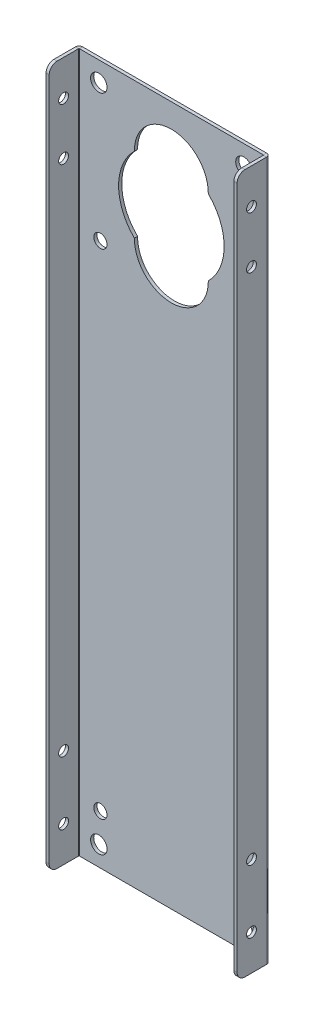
ISO-10303-21;
HEADER;
FILE_DESCRIPTION(('STEP AP214'),'2;1');
FILE_NAME('part.step','',(''),(''),'','','');
FILE_SCHEMA(('AUTOMOTIVE_DESIGN { 1 0 10303 214 1 1 1 1 }'));
ENDSEC;
DATA;
#1=APPLICATION_CONTEXT('core data for automotive mechanical design processes');
#2=APPLICATION_PROTOCOL_DEFINITION('international standard','automotive_design',2000,#1);
#3=PRODUCT_CONTEXT('',#1,'mechanical');
#4=PRODUCT('Part','Part','',(#3));
#5=PRODUCT_RELATED_PRODUCT_CATEGORY('part','',(#4));
#6=PRODUCT_DEFINITION_FORMATION('','',#4);
#7=PRODUCT_DEFINITION_CONTEXT('part definition',#1,'design');
#8=PRODUCT_DEFINITION('design','',#6,#7);
#9=PRODUCT_DEFINITION_SHAPE('','',#8);
#10=(LENGTH_UNIT() NAMED_UNIT(*) SI_UNIT(.MILLI.,.METRE.));
#11=(NAMED_UNIT(*) PLANE_ANGLE_UNIT() SI_UNIT($,.RADIAN.));
#12=(NAMED_UNIT(*) SI_UNIT($,.STERADIAN.) SOLID_ANGLE_UNIT());
#13=UNCERTAINTY_MEASURE_WITH_UNIT(LENGTH_MEASURE(1.E-05),#10,'distance_accuracy_value','');
#14=(GEOMETRIC_REPRESENTATION_CONTEXT(3) GLOBAL_UNCERTAINTY_ASSIGNED_CONTEXT((#13)) GLOBAL_UNIT_ASSIGNED_CONTEXT((#10,
#11,#12)) REPRESENTATION_CONTEXT('',''));
#15=CARTESIAN_POINT('',(0.,0.,0.));
#16=DIRECTION('',(0.,0.,1.));
#17=DIRECTION('',(1.,0.,0.));
#18=AXIS2_PLACEMENT_3D('',#15,#16,#17);
#19=CARTESIAN_POINT('',(-45.974,-168.275,1.51892));
#20=DIRECTION('',(0.,1.,0.));
#21=DIRECTION('',(0.,0.,1.));
#22=AXIS2_PLACEMENT_3D('',#19,#20,#21);
#23=PLANE('',#22);
#24=DIRECTION('',(0.,0.,-1.));
#25=VECTOR('',#24,1.);
#26=CARTESIAN_POINT('',(44.25188,-168.275,1.51891999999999));
#27=LINE('',#26,#25);
#28=CARTESIAN_POINT('',(44.25188,-168.275,1.51892));
#29=VERTEX_POINT('',#28);
#30=CARTESIAN_POINT('',(44.25188,-168.275,0.));
#31=VERTEX_POINT('',#30);
#32=EDGE_CURVE('E300',#29,#31,#27,.T.);
#33=ORIENTED_EDGE('',*,*,#32,.F.);
#34=DIRECTION('',(1.,0.,0.));
#35=VECTOR('',#34,1.);
#36=CARTESIAN_POINT('',(-45.974,-168.275,1.51892));
#37=LINE('',#36,#35);
#38=CARTESIAN_POINT('',(-44.25188,-168.275,1.51892));
#39=VERTEX_POINT('',#38);
#40=EDGE_CURVE('E355',#39,#29,#37,.T.);
#41=ORIENTED_EDGE('',*,*,#40,.F.);
#42=DIRECTION('',(0.,0.,-1.));
#43=VECTOR('',#42,1.);
#44=CARTESIAN_POINT('',(-44.25188,-168.275,1.51892000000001));
#45=LINE('',#44,#43);
#46=CARTESIAN_POINT('',(-44.25188,-168.275,0.));
#47=VERTEX_POINT('',#46);
#48=EDGE_CURVE('E339',#39,#47,#45,.T.);
#49=ORIENTED_EDGE('',*,*,#48,.T.);
#50=DIRECTION('',(1.,0.,0.));
#51=VECTOR('',#50,1.);
#52=CARTESIAN_POINT('',(-45.974,-168.275,0.));
#53=LINE('',#52,#51);
#54=EDGE_CURVE('E353',#47,#31,#53,.T.);
#55=ORIENTED_EDGE('',*,*,#54,.T.);
#56=EDGE_LOOP('',(#33,#41,#49,#55));
#57=FACE_BOUND('',#56,.T.);
#58=ADVANCED_FACE('F76',(#57),#23,.F.);
#59=CARTESIAN_POINT('',(-45.974,168.275,1.51892));
#60=DIRECTION('',(0.,-1.,0.));
#61=DIRECTION('',(0.,0.,-1.));
#62=AXIS2_PLACEMENT_3D('',#59,#60,#61);
#63=PLANE('',#62);
#64=DIRECTION('',(0.,0.,-1.));
#65=VECTOR('',#64,1.);
#66=CARTESIAN_POINT('',(44.25188,168.275,1.51891999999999));
#67=LINE('',#66,#65);
#68=CARTESIAN_POINT('',(44.25188,168.275,1.51892));
#69=VERTEX_POINT('',#68);
#70=CARTESIAN_POINT('',(44.25188,168.275,0.));
#71=VERTEX_POINT('',#70);
#72=EDGE_CURVE('E289',#69,#71,#67,.T.);
#73=ORIENTED_EDGE('',*,*,#72,.T.);
#74=DIRECTION('',(-1.,0.,0.));
#75=VECTOR('',#74,1.);
#76=CARTESIAN_POINT('',(-45.974,168.275,0.));
#77=LINE('',#76,#75);
#78=CARTESIAN_POINT('',(-44.25188,168.275,0.));
#79=VERTEX_POINT('',#78);
#80=EDGE_CURVE('E359',#71,#79,#77,.T.);
#81=ORIENTED_EDGE('',*,*,#80,.T.);
#82=DIRECTION('',(0.,0.,-1.));
#83=VECTOR('',#82,1.);
#84=CARTESIAN_POINT('',(-44.25188,168.275,1.51892000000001));
#85=LINE('',#84,#83);
#86=CARTESIAN_POINT('',(-44.25188,168.275,1.51892));
#87=VERTEX_POINT('',#86);
#88=EDGE_CURVE('E350',#87,#79,#85,.T.);
#89=ORIENTED_EDGE('',*,*,#88,.F.);
#90=DIRECTION('',(-1.,0.,0.));
#91=VECTOR('',#90,1.);
#92=CARTESIAN_POINT('',(-45.974,168.275,1.51892));
#93=LINE('',#92,#91);
#94=EDGE_CURVE('E358',#69,#87,#93,.T.);
#95=ORIENTED_EDGE('',*,*,#94,.F.);
#96=EDGE_LOOP('',(#73,#81,#89,#95));
#97=FACE_BOUND('',#96,.T.);
#98=ADVANCED_FACE('F566',(#97),#63,.F.);
#99=CARTESIAN_POINT('',(0.,0.,1.51892));
#100=DIRECTION('',(0.,0.,1.));
#101=DIRECTION('',(1.,0.,0.));
#102=AXIS2_PLACEMENT_3D('',#99,#100,#101);
#103=PLANE('',#102);
#104=CARTESIAN_POINT('',(-34.9309613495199,158.75435671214,1.51892));
#105=DIRECTION('',(0.,0.,-1.));
#106=DIRECTION('',(-1.,0.,0.));
#107=AXIS2_PLACEMENT_3D('',#104,#105,#106);
#108=CIRCLE('',#107,3.96239999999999);
#109=CARTESIAN_POINT('',(-38.8933613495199,158.75435671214,1.51892));
#110=VERTEX_POINT('',#109);
#111=EDGE_CURVE('E477',#110,#110,#108,.T.);
#112=ORIENTED_EDGE('',*,*,#111,.T.);
#113=EDGE_LOOP('',(#112));
#114=FACE_BOUND('',#113,.T.);
#115=CARTESIAN_POINT('',(34.91903865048,158.74182662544,1.51892));
#116=DIRECTION('',(0.,0.,-1.));
#117=DIRECTION('',(-1.,0.,0.));
#118=AXIS2_PLACEMENT_3D('',#115,#116,#117);
#119=CIRCLE('',#118,3.96239999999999);
#120=CARTESIAN_POINT('',(30.95663865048,158.74182662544,1.51892));
#121=VERTEX_POINT('',#120);
#122=EDGE_CURVE('E472',#121,#121,#119,.T.);
#123=ORIENTED_EDGE('',*,*,#122,.T.);
#124=EDGE_LOOP('',(#123));
#125=FACE_BOUND('',#124,.T.);
#126=CARTESIAN_POINT('',(34.15703865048,93.22958535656,1.51892));
#127=DIRECTION('',(0.,0.,-1.));
#128=DIRECTION('',(-1.,0.,0.));
#129=AXIS2_PLACEMENT_3D('',#126,#127,#128);
#130=CIRCLE('',#129,3.175);
#131=CARTESIAN_POINT('',(30.98203865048,93.22958535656,1.51892));
#132=VERTEX_POINT('',#131);
#133=EDGE_CURVE('E466',#132,#132,#130,.T.);
#134=ORIENTED_EDGE('',*,*,#133,.T.);
#135=EDGE_LOOP('',(#134));
#136=FACE_BOUND('',#135,.T.);
#137=CARTESIAN_POINT('',(-34.16896134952,93.22958535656,1.51892));
#138=DIRECTION('',(0.,0.,-1.));
#139=DIRECTION('',(-1.,0.,0.));
#140=AXIS2_PLACEMENT_3D('',#137,#138,#139);
#141=CIRCLE('',#140,3.175);
#142=CARTESIAN_POINT('',(-37.34396134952,93.22958535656,1.51892));
#143=VERTEX_POINT('',#142);
#144=EDGE_CURVE('E460',#143,#143,#141,.T.);
#145=ORIENTED_EDGE('',*,*,#144,.T.);
#146=EDGE_LOOP('',(#145));
#147=FACE_BOUND('',#146,.T.);
#148=CARTESIAN_POINT('',(34.15703865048,-144.51486366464,1.51892));
#149=DIRECTION('',(0.,0.,-1.));
#150=DIRECTION('',(-1.,0.,0.));
#151=AXIS2_PLACEMENT_3D('',#148,#149,#150);
#152=CIRCLE('',#151,3.175);
#153=CARTESIAN_POINT('',(30.98203865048,-144.51486366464,1.51892));
#154=VERTEX_POINT('',#153);
#155=EDGE_CURVE('E454',#154,#154,#152,.T.);
#156=ORIENTED_EDGE('',*,*,#155,.T.);
#157=EDGE_LOOP('',(#156));
#158=FACE_BOUND('',#157,.T.);
#159=CARTESIAN_POINT('',(34.91903865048,-158.75817337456,1.51892));
#160=DIRECTION('',(0.,0.,-1.));
#161=DIRECTION('',(-1.,0.,0.));
#162=AXIS2_PLACEMENT_3D('',#159,#160,#161);
#163=CIRCLE('',#162,3.96239999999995);
#164=CARTESIAN_POINT('',(30.9566386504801,-158.75817337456,1.51892));
#165=VERTEX_POINT('',#164);
#166=EDGE_CURVE('E448',#165,#165,#163,.T.);
#167=ORIENTED_EDGE('',*,*,#166,.T.);
#168=EDGE_LOOP('',(#167));
#169=FACE_BOUND('',#168,.T.);
#170=CARTESIAN_POINT('',(-34.16896134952,-144.51486366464,1.51892));
#171=DIRECTION('',(0.,0.,-1.));
#172=DIRECTION('',(-1.,0.,0.));
#173=AXIS2_PLACEMENT_3D('',#170,#171,#172);
#174=CIRCLE('',#173,3.175);
#175=CARTESIAN_POINT('',(-37.34396134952,-144.51486366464,1.51892));
#176=VERTEX_POINT('',#175);
#177=EDGE_CURVE('E442',#176,#176,#174,.T.);
#178=ORIENTED_EDGE('',*,*,#177,.T.);
#179=EDGE_LOOP('',(#178));
#180=FACE_BOUND('',#179,.T.);
#181=CARTESIAN_POINT('',(-34.9309613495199,-158.75817337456,1.51892));
#182=DIRECTION('',(0.,0.,-1.));
#183=DIRECTION('',(-1.,0.,0.));
#184=AXIS2_PLACEMENT_3D('',#181,#182,#183);
#185=CIRCLE('',#184,3.96239999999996);
#186=CARTESIAN_POINT('',(-38.8933613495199,-158.75817337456,1.51892));
#187=VERTEX_POINT('',#186);
#188=EDGE_CURVE('E246',#187,#187,#185,.T.);
#189=ORIENTED_EDGE('',*,*,#188,.T.);
#190=EDGE_LOOP('',(#189));
#191=FACE_BOUND('',#190,.T.);
#192=CARTESIAN_POINT('',(-0.00596134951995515,102.228583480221,1.51892));
#193=DIRECTION('',(0.,0.,-1.));
#194=DIRECTION('',(-1.,0.,0.));
#195=AXIS2_PLACEMENT_3D('',#192,#193,#194);
#196=CIRCLE('',#195,17.78);
#197=CARTESIAN_POINT('',(17.7719317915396,102.502290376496,1.51892));
#198=VERTEX_POINT('',#197);
#199=CARTESIAN_POINT('',(-17.7838544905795,102.502290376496,1.51892));
#200=VERTEX_POINT('',#199);
#201=EDGE_CURVE('E217',#198,#200,#196,.T.);
#202=ORIENTED_EDGE('',*,*,#201,.T.);
#203=CARTESIAN_POINT('',(-0.00596134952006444,120.64358347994,1.51892));
#204=DIRECTION('',(0.,0.,-1.));
#205=DIRECTION('',(-1.,0.,0.));
#206=AXIS2_PLACEMENT_3D('',#203,#204,#205);
#207=CIRCLE('',#206,25.4);
#208=CARTESIAN_POINT('',(-17.7838544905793,138.784876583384,1.51892));
#209=VERTEX_POINT('',#208);
#210=EDGE_CURVE('E226',#200,#209,#207,.T.);
#211=ORIENTED_EDGE('',*,*,#210,.T.);
#212=CARTESIAN_POINT('',(-0.00596134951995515,139.058583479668,1.51892));
#213=DIRECTION('',(0.,0.,-1.));
#214=DIRECTION('',(-1.,0.,0.));
#215=AXIS2_PLACEMENT_3D('',#212,#213,#214);
#216=CIRCLE('',#215,17.78);
#217=CARTESIAN_POINT('',(17.7719317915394,138.784876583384,1.51892));
#218=VERTEX_POINT('',#217);
#219=EDGE_CURVE('E93',#209,#218,#216,.T.);
#220=ORIENTED_EDGE('',*,*,#219,.T.);
#221=CARTESIAN_POINT('',(-0.00596134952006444,120.64358347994,1.51892));
#222=DIRECTION('',(0.,0.,-1.));
#223=DIRECTION('',(-1.,0.,0.));
#224=AXIS2_PLACEMENT_3D('',#221,#222,#223);
#225=CIRCLE('',#224,25.4000000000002);
#226=EDGE_CURVE('E223',#218,#198,#225,.T.);
#227=ORIENTED_EDGE('',*,*,#226,.T.);
#228=EDGE_LOOP('',(#202,#211,#220,#227));
#229=FACE_BOUND('',#228,.T.);
#230=ORIENTED_EDGE('',*,*,#40,.T.);
#231=DIRECTION('',(0.,1.,0.));
#232=VECTOR('',#231,1.);
#233=CARTESIAN_POINT('',(44.25188,168.275,1.51891999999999));
#234=LINE('',#233,#232);
#235=EDGE_CURVE('E295',#69,#29,#234,.F.);
#236=ORIENTED_EDGE('',*,*,#235,.F.);
#237=ORIENTED_EDGE('',*,*,#94,.T.);
#238=DIRECTION('',(0.,-1.,0.));
#239=VECTOR('',#238,1.);
#240=CARTESIAN_POINT('',(-44.25188,-168.275,1.51892000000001));
#241=LINE('',#240,#239);
#242=EDGE_CURVE('E345',#39,#87,#241,.F.);
#243=ORIENTED_EDGE('',*,*,#242,.F.);
#244=EDGE_LOOP('',(#230,#236,#237,#243));
#245=FACE_BOUND('',#244,.T.);
#246=ADVANCED_FACE('F230',(#114,#125,#136,#147,#158,#169,#180,#191,#229,#245),#103,.T.);
#247=CARTESIAN_POINT('',(0.,0.,0.));
#248=DIRECTION('',(0.,0.,1.));
#249=DIRECTION('',(1.,0.,0.));
#250=AXIS2_PLACEMENT_3D('',#247,#248,#249);
#251=PLANE('',#250);
#252=CARTESIAN_POINT('',(-34.9309613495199,158.75435671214,0.));
#253=DIRECTION('',(0.,0.,-1.));
#254=DIRECTION('',(-1.,0.,0.));
#255=AXIS2_PLACEMENT_3D('',#252,#253,#254);
#256=CIRCLE('',#255,3.96239999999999);
#257=CARTESIAN_POINT('',(-38.8933613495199,158.75435671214,0.));
#258=VERTEX_POINT('',#257);
#259=EDGE_CURVE('E239',#258,#258,#256,.T.);
#260=ORIENTED_EDGE('',*,*,#259,.F.);
#261=EDGE_LOOP('',(#260));
#262=FACE_BOUND('',#261,.T.);
#263=CARTESIAN_POINT('',(34.91903865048,158.74182662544,0.));
#264=DIRECTION('',(0.,0.,-1.));
#265=DIRECTION('',(-1.,0.,0.));
#266=AXIS2_PLACEMENT_3D('',#263,#264,#265);
#267=CIRCLE('',#266,3.96239999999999);
#268=CARTESIAN_POINT('',(30.95663865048,158.74182662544,0.));
#269=VERTEX_POINT('',#268);
#270=EDGE_CURVE('E475',#269,#269,#267,.T.);
#271=ORIENTED_EDGE('',*,*,#270,.F.);
#272=EDGE_LOOP('',(#271));
#273=FACE_BOUND('',#272,.T.);
#274=CARTESIAN_POINT('',(34.15703865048,93.22958535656,0.));
#275=DIRECTION('',(0.,0.,-1.));
#276=DIRECTION('',(-1.,0.,0.));
#277=AXIS2_PLACEMENT_3D('',#274,#275,#276);
#278=CIRCLE('',#277,3.175);
#279=CARTESIAN_POINT('',(30.98203865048,93.22958535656,0.));
#280=VERTEX_POINT('',#279);
#281=EDGE_CURVE('E469',#280,#280,#278,.T.);
#282=ORIENTED_EDGE('',*,*,#281,.F.);
#283=EDGE_LOOP('',(#282));
#284=FACE_BOUND('',#283,.T.);
#285=CARTESIAN_POINT('',(-34.16896134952,93.22958535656,0.));
#286=DIRECTION('',(0.,0.,-1.));
#287=DIRECTION('',(-1.,0.,0.));
#288=AXIS2_PLACEMENT_3D('',#285,#286,#287);
#289=CIRCLE('',#288,3.175);
#290=CARTESIAN_POINT('',(-37.34396134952,93.22958535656,0.));
#291=VERTEX_POINT('',#290);
#292=EDGE_CURVE('E463',#291,#291,#289,.T.);
#293=ORIENTED_EDGE('',*,*,#292,.F.);
#294=EDGE_LOOP('',(#293));
#295=FACE_BOUND('',#294,.T.);
#296=CARTESIAN_POINT('',(34.15703865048,-144.51486366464,0.));
#297=DIRECTION('',(0.,0.,-1.));
#298=DIRECTION('',(-1.,0.,0.));
#299=AXIS2_PLACEMENT_3D('',#296,#297,#298);
#300=CIRCLE('',#299,3.175);
#301=CARTESIAN_POINT('',(30.98203865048,-144.51486366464,0.));
#302=VERTEX_POINT('',#301);
#303=EDGE_CURVE('E457',#302,#302,#300,.T.);
#304=ORIENTED_EDGE('',*,*,#303,.F.);
#305=EDGE_LOOP('',(#304));
#306=FACE_BOUND('',#305,.T.);
#307=CARTESIAN_POINT('',(34.91903865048,-158.75817337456,0.));
#308=DIRECTION('',(0.,0.,-1.));
#309=DIRECTION('',(-1.,0.,0.));
#310=AXIS2_PLACEMENT_3D('',#307,#308,#309);
#311=CIRCLE('',#310,3.96239999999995);
#312=CARTESIAN_POINT('',(30.9566386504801,-158.75817337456,0.));
#313=VERTEX_POINT('',#312);
#314=EDGE_CURVE('E451',#313,#313,#311,.T.);
#315=ORIENTED_EDGE('',*,*,#314,.F.);
#316=EDGE_LOOP('',(#315));
#317=FACE_BOUND('',#316,.T.);
#318=CARTESIAN_POINT('',(-34.16896134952,-144.51486366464,0.));
#319=DIRECTION('',(0.,0.,-1.));
#320=DIRECTION('',(-1.,0.,0.));
#321=AXIS2_PLACEMENT_3D('',#318,#319,#320);
#322=CIRCLE('',#321,3.175);
#323=CARTESIAN_POINT('',(-37.34396134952,-144.51486366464,0.));
#324=VERTEX_POINT('',#323);
#325=EDGE_CURVE('E445',#324,#324,#322,.T.);
#326=ORIENTED_EDGE('',*,*,#325,.F.);
#327=EDGE_LOOP('',(#326));
#328=FACE_BOUND('',#327,.T.);
#329=CARTESIAN_POINT('',(-34.9309613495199,-158.75817337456,0.));
#330=DIRECTION('',(0.,0.,-1.));
#331=DIRECTION('',(-1.,0.,0.));
#332=AXIS2_PLACEMENT_3D('',#329,#330,#331);
#333=CIRCLE('',#332,3.96239999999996);
#334=CARTESIAN_POINT('',(-38.8933613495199,-158.75817337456,0.));
#335=VERTEX_POINT('',#334);
#336=EDGE_CURVE('E439',#335,#335,#333,.T.);
#337=ORIENTED_EDGE('',*,*,#336,.F.);
#338=EDGE_LOOP('',(#337));
#339=FACE_BOUND('',#338,.T.);
#340=CARTESIAN_POINT('',(-0.00596134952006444,120.64358347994,0.));
#341=DIRECTION('',(0.,0.,-1.));
#342=DIRECTION('',(-1.,0.,0.));
#343=AXIS2_PLACEMENT_3D('',#340,#341,#342);
#344=CIRCLE('',#343,25.4);
#345=CARTESIAN_POINT('',(-17.7838544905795,102.502290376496,0.));
#346=VERTEX_POINT('',#345);
#347=CARTESIAN_POINT('',(-17.7838544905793,138.784876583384,0.));
#348=VERTEX_POINT('',#347);
#349=EDGE_CURVE('E245',#346,#348,#344,.T.);
#350=ORIENTED_EDGE('',*,*,#349,.F.);
#351=CARTESIAN_POINT('',(-0.00596134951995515,102.228583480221,0.));
#352=DIRECTION('',(0.,0.,-1.));
#353=DIRECTION('',(-1.,0.,0.));
#354=AXIS2_PLACEMENT_3D('',#351,#352,#353);
#355=CIRCLE('',#354,17.78);
#356=CARTESIAN_POINT('',(17.7719317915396,102.502290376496,0.));
#357=VERTEX_POINT('',#356);
#358=EDGE_CURVE('E101',#357,#346,#355,.T.);
#359=ORIENTED_EDGE('',*,*,#358,.F.);
#360=CARTESIAN_POINT('',(-0.00596134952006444,120.64358347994,0.));
#361=DIRECTION('',(0.,0.,-1.));
#362=DIRECTION('',(-1.,0.,0.));
#363=AXIS2_PLACEMENT_3D('',#360,#361,#362);
#364=CIRCLE('',#363,25.4000000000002);
#365=CARTESIAN_POINT('',(17.7719317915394,138.784876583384,0.));
#366=VERTEX_POINT('',#365);
#367=EDGE_CURVE('E233',#366,#357,#364,.T.);
#368=ORIENTED_EDGE('',*,*,#367,.F.);
#369=CARTESIAN_POINT('',(-0.00596134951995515,139.058583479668,0.));
#370=DIRECTION('',(0.,0.,-1.));
#371=DIRECTION('',(-1.,0.,0.));
#372=AXIS2_PLACEMENT_3D('',#369,#370,#371);
#373=CIRCLE('',#372,17.78);
#374=EDGE_CURVE('E236',#348,#366,#373,.T.);
#375=ORIENTED_EDGE('',*,*,#374,.F.);
#376=EDGE_LOOP('',(#350,#359,#368,#375));
#377=FACE_BOUND('',#376,.T.);
#378=DIRECTION('',(0.,1.,0.));
#379=VECTOR('',#378,1.);
#380=CARTESIAN_POINT('',(44.25188,168.275,0.));
#381=LINE('',#380,#379);
#382=EDGE_CURVE('E283',#71,#31,#381,.F.);
#383=ORIENTED_EDGE('',*,*,#382,.T.);
#384=ORIENTED_EDGE('',*,*,#54,.F.);
#385=DIRECTION('',(0.,-1.,0.));
#386=VECTOR('',#385,1.);
#387=CARTESIAN_POINT('',(-44.25188,-168.275,0.));
#388=LINE('',#387,#386);
#389=EDGE_CURVE('E332',#47,#79,#388,.F.);
#390=ORIENTED_EDGE('',*,*,#389,.T.);
#391=ORIENTED_EDGE('',*,*,#80,.F.);
#392=EDGE_LOOP('',(#383,#384,#390,#391));
#393=FACE_BOUND('',#392,.T.);
#394=ADVANCED_FACE('F486',(#262,#273,#284,#295,#306,#317,#328,#339,#377,#393),#251,.F.);
#395=CARTESIAN_POINT('',(-44.25188,168.275,1.72212));
#396=DIRECTION('',(0.,1.,0.));
#397=DIRECTION('',(0.,0.,1.));
#398=AXIS2_PLACEMENT_3D('',#395,#396,#397);
#399=PLANE('',#398);
#400=DIRECTION('',(1.,0.,0.));
#401=VECTOR('',#400,1.);
#402=CARTESIAN_POINT('',(-45.974,168.275,1.72212));
#403=LINE('',#402,#401);
#404=CARTESIAN_POINT('',(-44.45508,168.275,1.72212));
#405=VERTEX_POINT('',#404);
#406=CARTESIAN_POINT('',(-45.974,168.275,1.72212));
#407=VERTEX_POINT('',#406);
#408=EDGE_CURVE('E303',#405,#407,#403,.F.);
#409=ORIENTED_EDGE('',*,*,#408,.F.);
#410=CARTESIAN_POINT('',(-44.25188,168.275,1.72212));
#411=DIRECTION('',(0.,-1.,0.));
#412=DIRECTION('',(0.,0.,-1.));
#413=AXIS2_PLACEMENT_3D('',#410,#411,#412);
#414=CIRCLE('',#413,0.203199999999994);
#415=EDGE_CURVE('E342',#87,#405,#414,.F.);
#416=ORIENTED_EDGE('',*,*,#415,.F.);
#417=ORIENTED_EDGE('',*,*,#88,.T.);
#418=CARTESIAN_POINT('',(-44.25188,168.275,1.72212));
#419=DIRECTION('',(0.,-1.,0.));
#420=DIRECTION('',(0.,0.,-1.));
#421=AXIS2_PLACEMENT_3D('',#418,#419,#420);
#422=CIRCLE('',#421,1.72211999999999);
#423=EDGE_CURVE('E335',#79,#407,#422,.F.);
#424=ORIENTED_EDGE('',*,*,#423,.T.);
#425=EDGE_LOOP('',(#409,#416,#417,#424));
#426=FACE_BOUND('',#425,.T.);
#427=ADVANCED_FACE('F489',(#426),#399,.T.);
#428=CARTESIAN_POINT('',(-44.25188,-168.275,1.72212));
#429=DIRECTION('',(0.,1.,0.));
#430=DIRECTION('',(0.,0.,1.));
#431=AXIS2_PLACEMENT_3D('',#428,#429,#430);
#432=PLANE('',#431);
#433=CARTESIAN_POINT('',(-44.25188,-168.275,1.72212));
#434=DIRECTION('',(0.,-1.,0.));
#435=DIRECTION('',(0.,0.,-1.));
#436=AXIS2_PLACEMENT_3D('',#433,#434,#435);
#437=CIRCLE('',#436,0.203199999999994);
#438=CARTESIAN_POINT('',(-44.45508,-168.275,1.72212));
#439=VERTEX_POINT('',#438);
#440=EDGE_CURVE('E307',#439,#39,#437,.T.);
#441=ORIENTED_EDGE('',*,*,#440,.F.);
#442=DIRECTION('',(1.,0.,0.));
#443=VECTOR('',#442,1.);
#444=CARTESIAN_POINT('',(-44.45508,-168.275,1.72212000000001));
#445=LINE('',#444,#443);
#446=CARTESIAN_POINT('',(-45.974,-168.275,1.72212));
#447=VERTEX_POINT('',#446);
#448=EDGE_CURVE('E325',#439,#447,#445,.F.);
#449=ORIENTED_EDGE('',*,*,#448,.T.);
#450=CARTESIAN_POINT('',(-44.25188,-168.275,1.72212));
#451=DIRECTION('',(0.,-1.,0.));
#452=DIRECTION('',(0.,0.,-1.));
#453=AXIS2_PLACEMENT_3D('',#450,#451,#452);
#454=CIRCLE('',#453,1.72211999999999);
#455=EDGE_CURVE('E336',#447,#47,#454,.T.);
#456=ORIENTED_EDGE('',*,*,#455,.T.);
#457=ORIENTED_EDGE('',*,*,#48,.F.);
#458=EDGE_LOOP('',(#441,#449,#456,#457));
#459=FACE_BOUND('',#458,.T.);
#460=ADVANCED_FACE('F638',(#459),#432,.F.);
#461=CARTESIAN_POINT('',(-44.25188,-168.275,1.72212));
#462=DIRECTION('',(0.,-1.,0.));
#463=DIRECTION('',(-1.,0.,0.));
#464=AXIS2_PLACEMENT_3D('',#461,#462,#463);
#465=CYLINDRICAL_SURFACE('',#464,1.72211999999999);
#466=ORIENTED_EDGE('',*,*,#389,.F.);
#467=ORIENTED_EDGE('',*,*,#455,.F.);
#468=DIRECTION('',(0.,-1.,0.));
#469=VECTOR('',#468,1.);
#470=CARTESIAN_POINT('',(-45.974,168.275,1.72212));
#471=LINE('',#470,#469);
#472=EDGE_CURVE('E322',#447,#407,#471,.F.);
#473=ORIENTED_EDGE('',*,*,#472,.T.);
#474=ORIENTED_EDGE('',*,*,#423,.F.);
#475=EDGE_LOOP('',(#466,#467,#473,#474));
#476=FACE_BOUND('',#475,.T.);
#477=ADVANCED_FACE('F635',(#476),#465,.T.);
#478=CARTESIAN_POINT('',(-44.25188,-168.275,1.72212));
#479=DIRECTION('',(0.,-1.,0.));
#480=DIRECTION('',(-1.,0.,0.));
#481=AXIS2_PLACEMENT_3D('',#478,#479,#480);
#482=CYLINDRICAL_SURFACE('',#481,0.203199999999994);
#483=ORIENTED_EDGE('',*,*,#242,.T.);
#484=ORIENTED_EDGE('',*,*,#415,.T.);
#485=DIRECTION('',(0.,-1.,0.));
#486=VECTOR('',#485,1.);
#487=CARTESIAN_POINT('',(-44.45508,168.275,1.72212));
#488=LINE('',#487,#486);
#489=EDGE_CURVE('E328',#405,#439,#488,.T.);
#490=ORIENTED_EDGE('',*,*,#489,.T.);
#491=ORIENTED_EDGE('',*,*,#440,.T.);
#492=EDGE_LOOP('',(#483,#484,#490,#491));
#493=FACE_BOUND('',#492,.T.);
#494=ADVANCED_FACE('F606',(#493),#482,.F.);
#495=CARTESIAN_POINT('',(-45.974,-168.275,15.875));
#496=DIRECTION('',(0.,1.,0.));
#497=DIRECTION('',(-1.,0.,0.));
#498=AXIS2_PLACEMENT_3D('',#495,#496,#497);
#499=PLANE('',#498);
#500=DIRECTION('',(0.,0.,-1.));
#501=VECTOR('',#500,1.);
#502=CARTESIAN_POINT('',(-44.4550800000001,-168.275,15.875));
#503=LINE('',#502,#501);
#504=CARTESIAN_POINT('',(-44.45508,-168.275,12.065));
#505=VERTEX_POINT('',#504);
#506=EDGE_CURVE('E319',#439,#505,#503,.F.);
#507=ORIENTED_EDGE('',*,*,#506,.T.);
#508=DIRECTION('',(1.,0.,0.));
#509=VECTOR('',#508,1.);
#510=CARTESIAN_POINT('',(-45.974,-168.275,12.065));
#511=LINE('',#510,#509);
#512=CARTESIAN_POINT('',(-45.974,-168.275,12.065));
#513=VERTEX_POINT('',#512);
#514=EDGE_CURVE('E389',#505,#513,#511,.F.);
#515=ORIENTED_EDGE('',*,*,#514,.T.);
#516=DIRECTION('',(0.,0.,1.));
#517=VECTOR('',#516,1.);
#518=CARTESIAN_POINT('',(-45.974,-168.275,-1.60851380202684E-13));
#519=LINE('',#518,#517);
#520=EDGE_CURVE('E311',#447,#513,#519,.T.);
#521=ORIENTED_EDGE('',*,*,#520,.F.);
#522=ORIENTED_EDGE('',*,*,#448,.F.);
#523=EDGE_LOOP('',(#507,#515,#521,#522));
#524=FACE_BOUND('',#523,.T.);
#525=ADVANCED_FACE('F615',(#524),#499,.F.);
#526=CARTESIAN_POINT('',(-45.974,168.275,1.51891999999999));
#527=DIRECTION('',(0.,-1.,0.));
#528=DIRECTION('',(1.,0.,0.));
#529=AXIS2_PLACEMENT_3D('',#526,#527,#528);
#530=PLANE('',#529);
#531=DIRECTION('',(0.,0.,-1.));
#532=VECTOR('',#531,1.);
#533=CARTESIAN_POINT('',(-45.974,168.275,-1.60851380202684E-13));
#534=LINE('',#533,#532);
#535=CARTESIAN_POINT('',(-45.974,168.275,12.065));
#536=VERTEX_POINT('',#535);
#537=EDGE_CURVE('E305',#536,#407,#534,.T.);
#538=ORIENTED_EDGE('',*,*,#537,.F.);
#539=DIRECTION('',(1.,0.,0.));
#540=VECTOR('',#539,1.);
#541=CARTESIAN_POINT('',(-45.974,168.275,12.065));
#542=LINE('',#541,#540);
#543=CARTESIAN_POINT('',(-44.45508,168.275,12.065));
#544=VERTEX_POINT('',#543);
#545=EDGE_CURVE('E13',#536,#544,#542,.T.);
#546=ORIENTED_EDGE('',*,*,#545,.T.);
#547=DIRECTION('',(0.,0.,1.));
#548=VECTOR('',#547,1.);
#549=CARTESIAN_POINT('',(-44.45508,168.275,1.51892));
#550=LINE('',#549,#548);
#551=EDGE_CURVE('E314',#544,#405,#550,.F.);
#552=ORIENTED_EDGE('',*,*,#551,.T.);
#553=ORIENTED_EDGE('',*,*,#408,.T.);
#554=EDGE_LOOP('',(#538,#546,#552,#553));
#555=FACE_BOUND('',#554,.T.);
#556=ADVANCED_FACE('F598',(#555),#530,.F.);
#557=CARTESIAN_POINT('',(-45.974,0.,-1.60851380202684E-13));
#558=DIRECTION('',(1.,0.,0.));
#559=DIRECTION('',(0.,0.,-1.));
#560=AXIS2_PLACEMENT_3D('',#557,#558,#559);
#561=PLANE('',#560);
#562=CARTESIAN_POINT('',(-45.9740000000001,151.1808,8.9408000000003));
#563=DIRECTION('',(1.,0.,0.));
#564=DIRECTION('',(0.,0.,-1.));
#565=AXIS2_PLACEMENT_3D('',#562,#563,#564);
#566=CIRCLE('',#565,2.38125);
#567=CARTESIAN_POINT('',(-45.9740000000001,151.1808,6.5595500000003));
#568=VERTEX_POINT('',#567);
#569=EDGE_CURVE('E889',#568,#568,#566,.T.);
#570=ORIENTED_EDGE('',*,*,#569,.T.);
#571=EDGE_LOOP('',(#570));
#572=FACE_BOUND('',#571,.T.);
#573=CARTESIAN_POINT('',(-45.9740000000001,126.1364,8.9408000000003));
#574=DIRECTION('',(1.,0.,0.));
#575=DIRECTION('',(0.,0.,-1.));
#576=AXIS2_PLACEMENT_3D('',#573,#574,#575);
#577=CIRCLE('',#576,2.38125);
#578=CARTESIAN_POINT('',(-45.9740000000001,126.1364,6.5595500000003));
#579=VERTEX_POINT('',#578);
#580=EDGE_CURVE('E408',#579,#579,#577,.T.);
#581=ORIENTED_EDGE('',*,*,#580,.T.);
#582=EDGE_LOOP('',(#581));
#583=FACE_BOUND('',#582,.T.);
#584=CARTESIAN_POINT('',(-45.9740000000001,-120.8278,8.9408000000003));
#585=DIRECTION('',(1.,0.,0.));
#586=DIRECTION('',(0.,0.,-1.));
#587=AXIS2_PLACEMENT_3D('',#584,#585,#586);
#588=CIRCLE('',#587,2.38124999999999);
#589=CARTESIAN_POINT('',(-45.9740000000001,-120.8278,6.55955000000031));
#590=VERTEX_POINT('',#589);
#591=EDGE_CURVE('E404',#590,#590,#588,.T.);
#592=ORIENTED_EDGE('',*,*,#591,.T.);
#593=EDGE_LOOP('',(#592));
#594=FACE_BOUND('',#593,.T.);
#595=CARTESIAN_POINT('',(-45.9740000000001,-151.1554,8.9408000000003));
#596=DIRECTION('',(1.,0.,0.));
#597=DIRECTION('',(0.,0.,-1.));
#598=AXIS2_PLACEMENT_3D('',#595,#596,#597);
#599=CIRCLE('',#598,2.38125);
#600=CARTESIAN_POINT('',(-45.9740000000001,-151.1554,6.5595500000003));
#601=VERTEX_POINT('',#600);
#602=EDGE_CURVE('E400',#601,#601,#599,.T.);
#603=ORIENTED_EDGE('',*,*,#602,.T.);
#604=EDGE_LOOP('',(#603));
#605=FACE_BOUND('',#604,.T.);
#606=ORIENTED_EDGE('',*,*,#520,.T.);
#607=CARTESIAN_POINT('',(-45.974,-164.465,12.065));
#608=DIRECTION('',(1.,0.,0.));
#609=DIRECTION('',(0.,0.,-1.));
#610=AXIS2_PLACEMENT_3D('',#607,#608,#609);
#611=CIRCLE('',#610,3.81);
#612=CARTESIAN_POINT('',(-45.974,-164.465,15.875));
#613=VERTEX_POINT('',#612);
#614=EDGE_CURVE('E393',#513,#613,#611,.F.);
#615=ORIENTED_EDGE('',*,*,#614,.T.);
#616=DIRECTION('',(0.,1.,0.));
#617=VECTOR('',#616,1.);
#618=CARTESIAN_POINT('',(-45.974,0.,15.875));
#619=LINE('',#618,#617);
#620=CARTESIAN_POINT('',(-45.974,164.465,15.875));
#621=VERTEX_POINT('',#620);
#622=EDGE_CURVE('E308',#613,#621,#619,.T.);
#623=ORIENTED_EDGE('',*,*,#622,.T.);
#624=CARTESIAN_POINT('',(-45.974,164.465,12.065));
#625=DIRECTION('',(1.,0.,0.));
#626=DIRECTION('',(0.,0.,-1.));
#627=AXIS2_PLACEMENT_3D('',#624,#625,#626);
#628=CIRCLE('',#627,3.81);
#629=EDGE_CURVE('E391',#621,#536,#628,.F.);
#630=ORIENTED_EDGE('',*,*,#629,.T.);
#631=ORIENTED_EDGE('',*,*,#537,.T.);
#632=ORIENTED_EDGE('',*,*,#472,.F.);
#633=EDGE_LOOP('',(#606,#615,#623,#630,#631,#632));
#634=FACE_BOUND('',#633,.T.);
#635=ADVANCED_FACE('F594',(#572,#583,#594,#605,#634),#561,.F.);
#636=CARTESIAN_POINT('',(-44.45508,0.,-1.55548099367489E-13));
#637=DIRECTION('',(1.,0.,0.));
#638=DIRECTION('',(0.,0.,-1.));
#639=AXIS2_PLACEMENT_3D('',#636,#637,#638);
#640=PLANE('',#639);
#641=CARTESIAN_POINT('',(-44.45508,151.1808,8.94080000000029));
#642=DIRECTION('',(1.,0.,0.));
#643=DIRECTION('',(0.,0.,-1.));
#644=AXIS2_PLACEMENT_3D('',#641,#642,#643);
#645=CIRCLE('',#644,2.38125);
#646=CARTESIAN_POINT('',(-44.45508,151.1808,6.55955000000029));
#647=VERTEX_POINT('',#646);
#648=EDGE_CURVE('E420',#647,#647,#645,.T.);
#649=ORIENTED_EDGE('',*,*,#648,.F.);
#650=EDGE_LOOP('',(#649));
#651=FACE_BOUND('',#650,.T.);
#652=CARTESIAN_POINT('',(-44.45508,126.1364,8.94080000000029));
#653=DIRECTION('',(1.,0.,0.));
#654=DIRECTION('',(0.,0.,-1.));
#655=AXIS2_PLACEMENT_3D('',#652,#653,#654);
#656=CIRCLE('',#655,2.38125);
#657=CARTESIAN_POINT('',(-44.45508,126.1364,6.55955000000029));
#658=VERTEX_POINT('',#657);
#659=EDGE_CURVE('E407',#658,#658,#656,.T.);
#660=ORIENTED_EDGE('',*,*,#659,.F.);
#661=EDGE_LOOP('',(#660));
#662=FACE_BOUND('',#661,.T.);
#663=CARTESIAN_POINT('',(-44.45508,-120.8278,8.94080000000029));
#664=DIRECTION('',(1.,0.,0.));
#665=DIRECTION('',(0.,0.,-1.));
#666=AXIS2_PLACEMENT_3D('',#663,#664,#665);
#667=CIRCLE('',#666,2.38124999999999);
#668=CARTESIAN_POINT('',(-44.45508,-120.8278,6.5595500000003));
#669=VERTEX_POINT('',#668);
#670=EDGE_CURVE('E403',#669,#669,#667,.T.);
#671=ORIENTED_EDGE('',*,*,#670,.F.);
#672=EDGE_LOOP('',(#671));
#673=FACE_BOUND('',#672,.T.);
#674=CARTESIAN_POINT('',(-44.45508,-151.1554,8.94080000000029));
#675=DIRECTION('',(1.,0.,0.));
#676=DIRECTION('',(0.,0.,-1.));
#677=AXIS2_PLACEMENT_3D('',#674,#675,#676);
#678=CIRCLE('',#677,2.38125);
#679=CARTESIAN_POINT('',(-44.45508,-151.1554,6.55955000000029));
#680=VERTEX_POINT('',#679);
#681=EDGE_CURVE('E399',#680,#680,#678,.T.);
#682=ORIENTED_EDGE('',*,*,#681,.F.);
#683=EDGE_LOOP('',(#682));
#684=FACE_BOUND('',#683,.T.);
#685=DIRECTION('',(0.,-1.,0.));
#686=VECTOR('',#685,1.);
#687=CARTESIAN_POINT('',(-44.45508,168.275,15.875));
#688=LINE('',#687,#686);
#689=CARTESIAN_POINT('',(-44.4550800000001,-164.465,15.875));
#690=VERTEX_POINT('',#689);
#691=CARTESIAN_POINT('',(-44.45508,164.465,15.875));
#692=VERTEX_POINT('',#691);
#693=EDGE_CURVE('E316',#690,#692,#688,.F.);
#694=ORIENTED_EDGE('',*,*,#693,.F.);
#695=CARTESIAN_POINT('',(-44.45508,-164.465,12.065));
#696=DIRECTION('',(1.,0.,0.));
#697=DIRECTION('',(0.,0.,-1.));
#698=AXIS2_PLACEMENT_3D('',#695,#696,#697);
#699=CIRCLE('',#698,3.81);
#700=EDGE_CURVE('E387',#690,#505,#699,.T.);
#701=ORIENTED_EDGE('',*,*,#700,.T.);
#702=ORIENTED_EDGE('',*,*,#506,.F.);
#703=ORIENTED_EDGE('',*,*,#489,.F.);
#704=ORIENTED_EDGE('',*,*,#551,.F.);
#705=CARTESIAN_POINT('',(-44.45508,164.465,12.065));
#706=DIRECTION('',(1.,0.,0.));
#707=DIRECTION('',(0.,0.,-1.));
#708=AXIS2_PLACEMENT_3D('',#705,#706,#707);
#709=CIRCLE('',#708,3.81);
#710=EDGE_CURVE('E385',#544,#692,#709,.T.);
#711=ORIENTED_EDGE('',*,*,#710,.T.);
#712=EDGE_LOOP('',(#694,#701,#702,#703,#704,#711));
#713=FACE_BOUND('',#712,.T.);
#714=ADVANCED_FACE('F611',(#651,#662,#673,#684,#713),#640,.T.);
#715=CARTESIAN_POINT('',(-45.974,168.275,15.875));
#716=DIRECTION('',(0.,0.,-1.));
#717=DIRECTION('',(-1.,0.,0.));
#718=AXIS2_PLACEMENT_3D('',#715,#716,#717);
#719=PLANE('',#718);
#720=ORIENTED_EDGE('',*,*,#622,.F.);
#721=DIRECTION('',(1.,0.,0.));
#722=VECTOR('',#721,1.);
#723=CARTESIAN_POINT('',(-45.974,-164.465,15.875));
#724=LINE('',#723,#722);
#725=EDGE_CURVE('E382',#613,#690,#724,.T.);
#726=ORIENTED_EDGE('',*,*,#725,.T.);
#727=ORIENTED_EDGE('',*,*,#693,.T.);
#728=DIRECTION('',(1.,0.,0.));
#729=VECTOR('',#728,1.);
#730=CARTESIAN_POINT('',(-45.974,164.465,15.875));
#731=LINE('',#730,#729);
#732=EDGE_CURVE('E380',#692,#621,#731,.F.);
#733=ORIENTED_EDGE('',*,*,#732,.T.);
#734=EDGE_LOOP('',(#720,#726,#727,#733));
#735=FACE_BOUND('',#734,.T.);
#736=ADVANCED_FACE('F620',(#735),#719,.F.);
#737=CARTESIAN_POINT('',(44.25188,-168.275,1.72211999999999));
#738=DIRECTION('',(0.,-1.,0.));
#739=DIRECTION('',(0.,0.,-1.));
#740=AXIS2_PLACEMENT_3D('',#737,#738,#739);
#741=PLANE('',#740);
#742=DIRECTION('',(-1.,0.,0.));
#743=VECTOR('',#742,1.);
#744=CARTESIAN_POINT('',(45.974,-168.275,1.72212));
#745=LINE('',#744,#743);
#746=CARTESIAN_POINT('',(44.45508,-168.275,1.72211999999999));
#747=VERTEX_POINT('',#746);
#748=CARTESIAN_POINT('',(45.974,-168.275,1.72211999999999));
#749=VERTEX_POINT('',#748);
#750=EDGE_CURVE('E252',#747,#749,#745,.F.);
#751=ORIENTED_EDGE('',*,*,#750,.F.);
#752=CARTESIAN_POINT('',(44.25188,-168.275,1.72211999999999));
#753=DIRECTION('',(0.,1.,0.));
#754=DIRECTION('',(0.,0.,1.));
#755=AXIS2_PLACEMENT_3D('',#752,#753,#754);
#756=CIRCLE('',#755,0.203200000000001);
#757=EDGE_CURVE('E292',#29,#747,#756,.F.);
#758=ORIENTED_EDGE('',*,*,#757,.F.);
#759=ORIENTED_EDGE('',*,*,#32,.T.);
#760=CARTESIAN_POINT('',(44.25188,-168.275,1.72211999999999));
#761=DIRECTION('',(0.,1.,0.));
#762=DIRECTION('',(0.,0.,1.));
#763=AXIS2_PLACEMENT_3D('',#760,#761,#762);
#764=CIRCLE('',#763,1.72212);
#765=EDGE_CURVE('E285',#31,#749,#764,.F.);
#766=ORIENTED_EDGE('',*,*,#765,.T.);
#767=EDGE_LOOP('',(#751,#758,#759,#766));
#768=FACE_BOUND('',#767,.T.);
#769=ADVANCED_FACE('F519',(#768),#741,.T.);
#770=CARTESIAN_POINT('',(44.25188,168.275,1.72211999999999));
#771=DIRECTION('',(0.,-1.,0.));
#772=DIRECTION('',(0.,0.,-1.));
#773=AXIS2_PLACEMENT_3D('',#770,#771,#772);
#774=PLANE('',#773);
#775=CARTESIAN_POINT('',(44.25188,168.275,1.72211999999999));
#776=DIRECTION('',(0.,1.,0.));
#777=DIRECTION('',(0.,0.,1.));
#778=AXIS2_PLACEMENT_3D('',#775,#776,#777);
#779=CIRCLE('',#778,0.203200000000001);
#780=CARTESIAN_POINT('',(44.45508,168.275,1.72211999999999));
#781=VERTEX_POINT('',#780);
#782=EDGE_CURVE('E259',#781,#69,#779,.T.);
#783=ORIENTED_EDGE('',*,*,#782,.F.);
#784=DIRECTION('',(-1.,0.,0.));
#785=VECTOR('',#784,1.);
#786=CARTESIAN_POINT('',(44.45508,168.275,1.72211999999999));
#787=LINE('',#786,#785);
#788=CARTESIAN_POINT('',(45.974,168.275,1.72211999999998));
#789=VERTEX_POINT('',#788);
#790=EDGE_CURVE('E276',#781,#789,#787,.F.);
#791=ORIENTED_EDGE('',*,*,#790,.T.);
#792=CARTESIAN_POINT('',(44.25188,168.275,1.72211999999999));
#793=DIRECTION('',(0.,1.,0.));
#794=DIRECTION('',(0.,0.,1.));
#795=AXIS2_PLACEMENT_3D('',#792,#793,#794);
#796=CIRCLE('',#795,1.72212);
#797=EDGE_CURVE('E286',#789,#71,#796,.T.);
#798=ORIENTED_EDGE('',*,*,#797,.T.);
#799=ORIENTED_EDGE('',*,*,#72,.F.);
#800=EDGE_LOOP('',(#783,#791,#798,#799));
#801=FACE_BOUND('',#800,.T.);
#802=ADVANCED_FACE('F627',(#801),#774,.F.);
#803=CARTESIAN_POINT('',(44.25188,168.275,1.72211999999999));
#804=DIRECTION('',(0.,1.,0.));
#805=DIRECTION('',(1.,0.,0.));
#806=AXIS2_PLACEMENT_3D('',#803,#804,#805);
#807=CYLINDRICAL_SURFACE('',#806,1.72212);
#808=ORIENTED_EDGE('',*,*,#382,.F.);
#809=ORIENTED_EDGE('',*,*,#797,.F.);
#810=DIRECTION('',(0.,1.,0.));
#811=VECTOR('',#810,1.);
#812=CARTESIAN_POINT('',(45.974,-168.275,1.72212));
#813=LINE('',#812,#811);
#814=EDGE_CURVE('E273',#789,#749,#813,.F.);
#815=ORIENTED_EDGE('',*,*,#814,.T.);
#816=ORIENTED_EDGE('',*,*,#765,.F.);
#817=EDGE_LOOP('',(#808,#809,#815,#816));
#818=FACE_BOUND('',#817,.T.);
#819=ADVANCED_FACE('F520',(#818),#807,.T.);
#820=CARTESIAN_POINT('',(44.25188,168.275,1.72211999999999));
#821=DIRECTION('',(0.,1.,0.));
#822=DIRECTION('',(1.,0.,0.));
#823=AXIS2_PLACEMENT_3D('',#820,#821,#822);
#824=CYLINDRICAL_SURFACE('',#823,0.203200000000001);
#825=ORIENTED_EDGE('',*,*,#235,.T.);
#826=ORIENTED_EDGE('',*,*,#757,.T.);
#827=DIRECTION('',(0.,1.,0.));
#828=VECTOR('',#827,1.);
#829=CARTESIAN_POINT('',(44.45508,-168.275,1.72212));
#830=LINE('',#829,#828);
#831=EDGE_CURVE('E279',#747,#781,#830,.T.);
#832=ORIENTED_EDGE('',*,*,#831,.T.);
#833=ORIENTED_EDGE('',*,*,#782,.T.);
#834=EDGE_LOOP('',(#825,#826,#832,#833));
#835=FACE_BOUND('',#834,.T.);
#836=ADVANCED_FACE('F549',(#835),#824,.F.);
#837=CARTESIAN_POINT('',(45.974,-168.275,1.51891999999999));
#838=DIRECTION('',(0.,1.,0.));
#839=DIRECTION('',(0.,0.,1.));
#840=AXIS2_PLACEMENT_3D('',#837,#838,#839);
#841=PLANE('',#840);
#842=DIRECTION('',(0.,0.,-1.));
#843=VECTOR('',#842,1.);
#844=CARTESIAN_POINT('',(45.974,-168.275,-1.60851380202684E-13));
#845=LINE('',#844,#843);
#846=CARTESIAN_POINT('',(45.974,-168.275,12.065));
#847=VERTEX_POINT('',#846);
#848=EDGE_CURVE('E263',#847,#749,#845,.T.);
#849=ORIENTED_EDGE('',*,*,#848,.F.);
#850=DIRECTION('',(-1.,0.,0.));
#851=VECTOR('',#850,1.);
#852=CARTESIAN_POINT('',(45.974,-168.275,12.065));
#853=LINE('',#852,#851);
#854=CARTESIAN_POINT('',(44.4550800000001,-168.275,12.065));
#855=VERTEX_POINT('',#854);
#856=EDGE_CURVE('E361',#847,#855,#853,.T.);
#857=ORIENTED_EDGE('',*,*,#856,.T.);
#858=DIRECTION('',(0.,0.,1.));
#859=VECTOR('',#858,1.);
#860=CARTESIAN_POINT('',(44.45508,-168.275,1.51892));
#861=LINE('',#860,#859);
#862=EDGE_CURVE('E271',#855,#747,#861,.F.);
#863=ORIENTED_EDGE('',*,*,#862,.T.);
#864=ORIENTED_EDGE('',*,*,#750,.T.);
#865=EDGE_LOOP('',(#849,#857,#863,#864));
#866=FACE_BOUND('',#865,.T.);
#867=ADVANCED_FACE('F545',(#866),#841,.F.);
#868=CARTESIAN_POINT('',(45.9740000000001,168.275,15.875));
#869=DIRECTION('',(0.,-1.,0.));
#870=DIRECTION('',(0.,0.,-1.));
#871=AXIS2_PLACEMENT_3D('',#868,#869,#870);
#872=PLANE('',#871);
#873=DIRECTION('',(0.,0.,-1.));
#874=VECTOR('',#873,1.);
#875=CARTESIAN_POINT('',(44.4550800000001,168.275,15.875));
#876=LINE('',#875,#874);
#877=CARTESIAN_POINT('',(44.4550800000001,168.275,12.065));
#878=VERTEX_POINT('',#877);
#879=EDGE_CURVE('E268',#781,#878,#876,.F.);
#880=ORIENTED_EDGE('',*,*,#879,.T.);
#881=DIRECTION('',(-1.,0.,0.));
#882=VECTOR('',#881,1.);
#883=CARTESIAN_POINT('',(45.974,168.275,12.065));
#884=LINE('',#883,#882);
#885=CARTESIAN_POINT('',(45.974,168.275,12.065));
#886=VERTEX_POINT('',#885);
#887=EDGE_CURVE('E85',#878,#886,#884,.F.);
#888=ORIENTED_EDGE('',*,*,#887,.T.);
#889=DIRECTION('',(0.,0.,1.));
#890=VECTOR('',#889,1.);
#891=CARTESIAN_POINT('',(45.974,168.275,-1.60851380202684E-13));
#892=LINE('',#891,#890);
#893=EDGE_CURVE('E260',#789,#886,#892,.T.);
#894=ORIENTED_EDGE('',*,*,#893,.F.);
#895=ORIENTED_EDGE('',*,*,#790,.F.);
#896=EDGE_LOOP('',(#880,#888,#894,#895));
#897=FACE_BOUND('',#896,.T.);
#898=ADVANCED_FACE('F529',(#897),#872,.F.);
#899=CARTESIAN_POINT('',(45.974,0.,-1.60851380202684E-13));
#900=DIRECTION('',(-1.,0.,0.));
#901=DIRECTION('',(0.,0.,1.));
#902=AXIS2_PLACEMENT_3D('',#899,#900,#901);
#903=PLANE('',#902);
#904=CARTESIAN_POINT('',(45.974,151.1808,8.94079999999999));
#905=DIRECTION('',(1.,0.,0.));
#906=DIRECTION('',(0.,0.,-1.));
#907=AXIS2_PLACEMENT_3D('',#904,#905,#906);
#908=CIRCLE('',#907,2.38125);
#909=CARTESIAN_POINT('',(45.974,151.1808,6.55954999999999));
#910=VERTEX_POINT('',#909);
#911=EDGE_CURVE('E890',#910,#910,#908,.T.);
#912=ORIENTED_EDGE('',*,*,#911,.F.);
#913=EDGE_LOOP('',(#912));
#914=FACE_BOUND('',#913,.T.);
#915=CARTESIAN_POINT('',(45.974,126.1364,8.94079999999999));
#916=DIRECTION('',(1.,0.,0.));
#917=DIRECTION('',(0.,0.,-1.));
#918=AXIS2_PLACEMENT_3D('',#915,#916,#917);
#919=CIRCLE('',#918,2.38125);
#920=CARTESIAN_POINT('',(45.974,126.1364,6.55954999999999));
#921=VERTEX_POINT('',#920);
#922=EDGE_CURVE('E415',#921,#921,#919,.T.);
#923=ORIENTED_EDGE('',*,*,#922,.F.);
#924=EDGE_LOOP('',(#923));
#925=FACE_BOUND('',#924,.T.);
#926=CARTESIAN_POINT('',(45.974,-120.8278,8.94079999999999));
#927=DIRECTION('',(1.,0.,0.));
#928=DIRECTION('',(0.,0.,-1.));
#929=AXIS2_PLACEMENT_3D('',#926,#927,#928);
#930=CIRCLE('',#929,2.38125);
#931=CARTESIAN_POINT('',(45.974,-120.8278,6.55954999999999));
#932=VERTEX_POINT('',#931);
#933=EDGE_CURVE('E412',#932,#932,#930,.T.);
#934=ORIENTED_EDGE('',*,*,#933,.F.);
#935=EDGE_LOOP('',(#934));
#936=FACE_BOUND('',#935,.T.);
#937=CARTESIAN_POINT('',(45.974,-151.1554,8.94079999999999));
#938=DIRECTION('',(1.,0.,0.));
#939=DIRECTION('',(0.,0.,-1.));
#940=AXIS2_PLACEMENT_3D('',#937,#938,#939);
#941=CIRCLE('',#940,2.38125);
#942=CARTESIAN_POINT('',(45.974,-151.1554,6.55954999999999));
#943=VERTEX_POINT('',#942);
#944=EDGE_CURVE('E430',#943,#943,#941,.T.);
#945=ORIENTED_EDGE('',*,*,#944,.F.);
#946=EDGE_LOOP('',(#945));
#947=FACE_BOUND('',#946,.T.);
#948=DIRECTION('',(0.,-1.,0.));
#949=VECTOR('',#948,1.);
#950=CARTESIAN_POINT('',(45.9740000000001,0.,15.875));
#951=LINE('',#950,#949);
#952=CARTESIAN_POINT('',(45.9740000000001,164.465,15.875));
#953=VERTEX_POINT('',#952);
#954=CARTESIAN_POINT('',(45.9740000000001,-164.465,15.875));
#955=VERTEX_POINT('',#954);
#956=EDGE_CURVE('E256',#953,#955,#951,.T.);
#957=ORIENTED_EDGE('',*,*,#956,.T.);
#958=CARTESIAN_POINT('',(45.974,-164.465,12.065));
#959=DIRECTION('',(-1.,0.,0.));
#960=DIRECTION('',(0.,0.,1.));
#961=AXIS2_PLACEMENT_3D('',#958,#959,#960);
#962=CIRCLE('',#961,3.81);
#963=EDGE_CURVE('E378',#955,#847,#962,.F.);
#964=ORIENTED_EDGE('',*,*,#963,.T.);
#965=ORIENTED_EDGE('',*,*,#848,.T.);
#966=ORIENTED_EDGE('',*,*,#814,.F.);
#967=ORIENTED_EDGE('',*,*,#893,.T.);
#968=CARTESIAN_POINT('',(45.974,164.465,12.065));
#969=DIRECTION('',(-1.,0.,0.));
#970=DIRECTION('',(0.,0.,1.));
#971=AXIS2_PLACEMENT_3D('',#968,#969,#970);
#972=CIRCLE('',#971,3.81);
#973=EDGE_CURVE('E376',#886,#953,#972,.F.);
#974=ORIENTED_EDGE('',*,*,#973,.T.);
#975=EDGE_LOOP('',(#957,#964,#965,#966,#967,#974));
#976=FACE_BOUND('',#975,.T.);
#977=ADVANCED_FACE('F524',(#914,#925,#936,#947,#976),#903,.F.);
#978=CARTESIAN_POINT('',(44.45508,0.,-1.55548099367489E-13));
#979=DIRECTION('',(-1.,0.,0.));
#980=DIRECTION('',(0.,0.,1.));
#981=AXIS2_PLACEMENT_3D('',#978,#979,#980);
#982=PLANE('',#981);
#983=CARTESIAN_POINT('',(44.45508,151.1808,8.94079999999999));
#984=DIRECTION('',(-1.,0.,0.));
#985=DIRECTION('',(0.,0.,1.));
#986=AXIS2_PLACEMENT_3D('',#983,#984,#985);
#987=CIRCLE('',#986,2.38125);
#988=CARTESIAN_POINT('',(44.45508,151.1808,11.32205));
#989=VERTEX_POINT('',#988);
#990=EDGE_CURVE('E80',#989,#989,#987,.T.);
#991=ORIENTED_EDGE('',*,*,#990,.F.);
#992=EDGE_LOOP('',(#991));
#993=FACE_BOUND('',#992,.T.);
#994=CARTESIAN_POINT('',(44.45508,126.1364,8.94079999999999));
#995=DIRECTION('',(-1.,0.,0.));
#996=DIRECTION('',(0.,0.,1.));
#997=AXIS2_PLACEMENT_3D('',#994,#995,#996);
#998=CIRCLE('',#997,2.38125);
#999=CARTESIAN_POINT('',(44.45508,126.1364,11.32205));
#1000=VERTEX_POINT('',#999);
#1001=EDGE_CURVE('E405',#1000,#1000,#998,.T.);
#1002=ORIENTED_EDGE('',*,*,#1001,.F.);
#1003=EDGE_LOOP('',(#1002));
#1004=FACE_BOUND('',#1003,.T.);
#1005=CARTESIAN_POINT('',(44.45508,-120.8278,8.94079999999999));
#1006=DIRECTION('',(-1.,0.,0.));
#1007=DIRECTION('',(0.,0.,1.));
#1008=AXIS2_PLACEMENT_3D('',#1005,#1006,#1007);
#1009=CIRCLE('',#1008,2.38124999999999);
#1010=CARTESIAN_POINT('',(44.45508,-120.8278,11.32205));
#1011=VERTEX_POINT('',#1010);
#1012=EDGE_CURVE('E401',#1011,#1011,#1009,.T.);
#1013=ORIENTED_EDGE('',*,*,#1012,.F.);
#1014=EDGE_LOOP('',(#1013));
#1015=FACE_BOUND('',#1014,.T.);
#1016=CARTESIAN_POINT('',(44.45508,-151.1554,8.94079999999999));
#1017=DIRECTION('',(-1.,0.,0.));
#1018=DIRECTION('',(0.,0.,1.));
#1019=AXIS2_PLACEMENT_3D('',#1016,#1017,#1018);
#1020=CIRCLE('',#1019,2.38125);
#1021=CARTESIAN_POINT('',(44.45508,-151.1554,11.32205));
#1022=VERTEX_POINT('',#1021);
#1023=EDGE_CURVE('E396',#1022,#1022,#1020,.T.);
#1024=ORIENTED_EDGE('',*,*,#1023,.F.);
#1025=EDGE_LOOP('',(#1024));
#1026=FACE_BOUND('',#1025,.T.);
#1027=ORIENTED_EDGE('',*,*,#862,.F.);
#1028=CARTESIAN_POINT('',(44.4550800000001,-164.465,12.065));
#1029=DIRECTION('',(-1.,0.,0.));
#1030=DIRECTION('',(0.,0.,1.));
#1031=AXIS2_PLACEMENT_3D('',#1028,#1029,#1030);
#1032=CIRCLE('',#1031,3.81);
#1033=CARTESIAN_POINT('',(44.4550800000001,-164.465,15.875));
#1034=VERTEX_POINT('',#1033);
#1035=EDGE_CURVE('E369',#855,#1034,#1032,.T.);
#1036=ORIENTED_EDGE('',*,*,#1035,.T.);
#1037=DIRECTION('',(0.,1.,0.));
#1038=VECTOR('',#1037,1.);
#1039=CARTESIAN_POINT('',(44.4550800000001,-168.275,15.875));
#1040=LINE('',#1039,#1038);
#1041=CARTESIAN_POINT('',(44.4550800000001,164.465,15.875));
#1042=VERTEX_POINT('',#1041);
#1043=EDGE_CURVE('E265',#1042,#1034,#1040,.F.);
#1044=ORIENTED_EDGE('',*,*,#1043,.F.);
#1045=CARTESIAN_POINT('',(44.4550800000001,164.465,12.065));
#1046=DIRECTION('',(-1.,0.,0.));
#1047=DIRECTION('',(0.,0.,1.));
#1048=AXIS2_PLACEMENT_3D('',#1045,#1046,#1047);
#1049=CIRCLE('',#1048,3.81);
#1050=EDGE_CURVE('E367',#1042,#878,#1049,.T.);
#1051=ORIENTED_EDGE('',*,*,#1050,.T.);
#1052=ORIENTED_EDGE('',*,*,#879,.F.);
#1053=ORIENTED_EDGE('',*,*,#831,.F.);
#1054=EDGE_LOOP('',(#1027,#1036,#1044,#1051,#1052,#1053));
#1055=FACE_BOUND('',#1054,.T.);
#1056=ADVANCED_FACE('F552',(#993,#1004,#1015,#1026,#1055),#982,.T.);
#1057=CARTESIAN_POINT('',(45.9740000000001,-168.275,15.875));
#1058=DIRECTION('',(0.,0.,-1.));
#1059=DIRECTION('',(-1.,0.,0.));
#1060=AXIS2_PLACEMENT_3D('',#1057,#1058,#1059);
#1061=PLANE('',#1060);
#1062=ORIENTED_EDGE('',*,*,#1043,.T.);
#1063=DIRECTION('',(-1.,0.,0.));
#1064=VECTOR('',#1063,1.);
#1065=CARTESIAN_POINT('',(45.9740000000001,-164.465,15.875));
#1066=LINE('',#1065,#1064);
#1067=EDGE_CURVE('E374',#1034,#955,#1066,.F.);
#1068=ORIENTED_EDGE('',*,*,#1067,.T.);
#1069=ORIENTED_EDGE('',*,*,#956,.F.);
#1070=DIRECTION('',(-1.,0.,0.));
#1071=VECTOR('',#1070,1.);
#1072=CARTESIAN_POINT('',(45.9740000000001,164.465,15.875));
#1073=LINE('',#1072,#1071);
#1074=EDGE_CURVE('E371',#953,#1042,#1073,.T.);
#1075=ORIENTED_EDGE('',*,*,#1074,.T.);
#1076=EDGE_LOOP('',(#1062,#1068,#1069,#1075));
#1077=FACE_BOUND('',#1076,.T.);
#1078=ADVANCED_FACE('F538',(#1077),#1061,.F.);
#1079=CARTESIAN_POINT('',(45.974,-164.465,12.065));
#1080=DIRECTION('',(-1.,0.,0.));
#1081=DIRECTION('',(0.,0.,1.));
#1082=AXIS2_PLACEMENT_3D('',#1079,#1080,#1081);
#1083=CYLINDRICAL_SURFACE('',#1082,3.81);
#1084=ORIENTED_EDGE('',*,*,#963,.F.);
#1085=ORIENTED_EDGE('',*,*,#1067,.F.);
#1086=ORIENTED_EDGE('',*,*,#1035,.F.);
#1087=ORIENTED_EDGE('',*,*,#856,.F.);
#1088=EDGE_LOOP('',(#1084,#1085,#1086,#1087));
#1089=FACE_BOUND('',#1088,.T.);
#1090=ADVANCED_FACE('F542',(#1089),#1083,.T.);
#1091=CARTESIAN_POINT('',(-45.974,-164.465,12.065));
#1092=DIRECTION('',(1.,0.,0.));
#1093=DIRECTION('',(0.,0.,-1.));
#1094=AXIS2_PLACEMENT_3D('',#1091,#1092,#1093);
#1095=CYLINDRICAL_SURFACE('',#1094,3.81);
#1096=ORIENTED_EDGE('',*,*,#614,.F.);
#1097=ORIENTED_EDGE('',*,*,#514,.F.);
#1098=ORIENTED_EDGE('',*,*,#700,.F.);
#1099=ORIENTED_EDGE('',*,*,#725,.F.);
#1100=EDGE_LOOP('',(#1096,#1097,#1098,#1099));
#1101=FACE_BOUND('',#1100,.T.);
#1102=ADVANCED_FACE('F576',(#1101),#1095,.T.);
#1103=CARTESIAN_POINT('',(45.974,164.465,12.065));
#1104=DIRECTION('',(-1.,0.,0.));
#1105=DIRECTION('',(0.,0.,1.));
#1106=AXIS2_PLACEMENT_3D('',#1103,#1104,#1105);
#1107=CYLINDRICAL_SURFACE('',#1106,3.81);
#1108=ORIENTED_EDGE('',*,*,#973,.F.);
#1109=ORIENTED_EDGE('',*,*,#887,.F.);
#1110=ORIENTED_EDGE('',*,*,#1050,.F.);
#1111=ORIENTED_EDGE('',*,*,#1074,.F.);
#1112=EDGE_LOOP('',(#1108,#1109,#1110,#1111));
#1113=FACE_BOUND('',#1112,.T.);
#1114=ADVANCED_FACE('F533',(#1113),#1107,.T.);
#1115=CARTESIAN_POINT('',(-45.974,164.465,12.065));
#1116=DIRECTION('',(1.,0.,0.));
#1117=DIRECTION('',(0.,0.,-1.));
#1118=AXIS2_PLACEMENT_3D('',#1115,#1116,#1117);
#1119=CYLINDRICAL_SURFACE('',#1118,3.81);
#1120=ORIENTED_EDGE('',*,*,#629,.F.);
#1121=ORIENTED_EDGE('',*,*,#732,.F.);
#1122=ORIENTED_EDGE('',*,*,#710,.F.);
#1123=ORIENTED_EDGE('',*,*,#545,.F.);
#1124=EDGE_LOOP('',(#1120,#1121,#1122,#1123));
#1125=FACE_BOUND('',#1124,.T.);
#1126=ADVANCED_FACE('F78',(#1125),#1119,.T.);
#1127=CARTESIAN_POINT('',(-0.00596134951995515,102.228583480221,1.51892));
#1128=DIRECTION('',(0.,0.,-1.));
#1129=DIRECTION('',(-1.,0.,0.));
#1130=AXIS2_PLACEMENT_3D('',#1127,#1128,#1129);
#1131=CYLINDRICAL_SURFACE('',#1130,17.78);
#1132=ORIENTED_EDGE('',*,*,#358,.T.);
#1133=DIRECTION('',(0.,0.,-1.));
#1134=VECTOR('',#1133,1.);
#1135=CARTESIAN_POINT('',(-17.7838544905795,102.502290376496,1.51892));
#1136=LINE('',#1135,#1134);
#1137=EDGE_CURVE('E213',#200,#346,#1136,.T.);
#1138=ORIENTED_EDGE('',*,*,#1137,.F.);
#1139=ORIENTED_EDGE('',*,*,#201,.F.);
#1140=DIRECTION('',(0.,0.,-1.));
#1141=VECTOR('',#1140,1.);
#1142=CARTESIAN_POINT('',(17.7719317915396,102.502290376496,1.51892));
#1143=LINE('',#1142,#1141);
#1144=EDGE_CURVE('E250',#198,#357,#1143,.T.);
#1145=ORIENTED_EDGE('',*,*,#1144,.T.);
#1146=EDGE_LOOP('',(#1132,#1138,#1139,#1145));
#1147=FACE_BOUND('',#1146,.T.);
#1148=ADVANCED_FACE('F215',(#1147),#1131,.F.);
#1149=CARTESIAN_POINT('',(-0.00596134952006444,120.64358347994,1.51892));
#1150=DIRECTION('',(0.,0.,-1.));
#1151=DIRECTION('',(-1.,0.,0.));
#1152=AXIS2_PLACEMENT_3D('',#1149,#1150,#1151);
#1153=CYLINDRICAL_SURFACE('',#1152,25.4000000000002);
#1154=ORIENTED_EDGE('',*,*,#367,.T.);
#1155=ORIENTED_EDGE('',*,*,#1144,.F.);
#1156=ORIENTED_EDGE('',*,*,#226,.F.);
#1157=DIRECTION('',(0.,0.,-1.));
#1158=VECTOR('',#1157,1.);
#1159=CARTESIAN_POINT('',(17.7719317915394,138.784876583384,1.51892));
#1160=LINE('',#1159,#1158);
#1161=EDGE_CURVE('E253',#218,#366,#1160,.T.);
#1162=ORIENTED_EDGE('',*,*,#1161,.T.);
#1163=EDGE_LOOP('',(#1154,#1155,#1156,#1162));
#1164=FACE_BOUND('',#1163,.T.);
#1165=ADVANCED_FACE('F587',(#1164),#1153,.F.);
#1166=CARTESIAN_POINT('',(-0.00596134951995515,139.058583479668,1.51892));
#1167=DIRECTION('',(0.,0.,-1.));
#1168=DIRECTION('',(-1.,0.,0.));
#1169=AXIS2_PLACEMENT_3D('',#1166,#1167,#1168);
#1170=CYLINDRICAL_SURFACE('',#1169,17.78);
#1171=ORIENTED_EDGE('',*,*,#374,.T.);
#1172=ORIENTED_EDGE('',*,*,#1161,.F.);
#1173=ORIENTED_EDGE('',*,*,#219,.F.);
#1174=DIRECTION('',(0.,0.,-1.));
#1175=VECTOR('',#1174,1.);
#1176=CARTESIAN_POINT('',(-17.7838544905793,138.784876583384,1.51892));
#1177=LINE('',#1176,#1175);
#1178=EDGE_CURVE('E222',#209,#348,#1177,.T.);
#1179=ORIENTED_EDGE('',*,*,#1178,.T.);
#1180=EDGE_LOOP('',(#1171,#1172,#1173,#1179));
#1181=FACE_BOUND('',#1180,.T.);
#1182=ADVANCED_FACE('F677',(#1181),#1170,.F.);
#1183=CARTESIAN_POINT('',(-0.00596134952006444,120.64358347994,1.51892));
#1184=DIRECTION('',(0.,0.,-1.));
#1185=DIRECTION('',(-1.,0.,0.));
#1186=AXIS2_PLACEMENT_3D('',#1183,#1184,#1185);
#1187=CYLINDRICAL_SURFACE('',#1186,25.4);
#1188=ORIENTED_EDGE('',*,*,#349,.T.);
#1189=ORIENTED_EDGE('',*,*,#1178,.F.);
#1190=ORIENTED_EDGE('',*,*,#210,.F.);
#1191=ORIENTED_EDGE('',*,*,#1137,.T.);
#1192=EDGE_LOOP('',(#1188,#1189,#1190,#1191));
#1193=FACE_BOUND('',#1192,.T.);
#1194=ADVANCED_FACE('F227',(#1193),#1187,.F.);
#1195=CARTESIAN_POINT('',(-34.9309613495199,-158.75817337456,1.51892));
#1196=DIRECTION('',(0.,0.,-1.));
#1197=DIRECTION('',(-1.,0.,0.));
#1198=AXIS2_PLACEMENT_3D('',#1195,#1196,#1197);
#1199=CYLINDRICAL_SURFACE('',#1198,3.96239999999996);
#1200=ORIENTED_EDGE('',*,*,#188,.F.);
#1201=EDGE_LOOP('',(#1200));
#1202=FACE_BOUND('',#1201,.T.);
#1203=ORIENTED_EDGE('',*,*,#336,.T.);
#1204=EDGE_LOOP('',(#1203));
#1205=FACE_BOUND('',#1204,.T.);
#1206=ADVANCED_FACE('F665',(#1202,#1205),#1199,.F.);
#1207=CARTESIAN_POINT('',(-34.16896134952,-144.51486366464,1.51892));
#1208=DIRECTION('',(0.,0.,-1.));
#1209=DIRECTION('',(-1.,0.,0.));
#1210=AXIS2_PLACEMENT_3D('',#1207,#1208,#1209);
#1211=CYLINDRICAL_SURFACE('',#1210,3.175);
#1212=ORIENTED_EDGE('',*,*,#177,.F.);
#1213=EDGE_LOOP('',(#1212));
#1214=FACE_BOUND('',#1213,.T.);
#1215=ORIENTED_EDGE('',*,*,#325,.T.);
#1216=EDGE_LOOP('',(#1215));
#1217=FACE_BOUND('',#1216,.T.);
#1218=ADVANCED_FACE('F668',(#1214,#1217),#1211,.F.);
#1219=CARTESIAN_POINT('',(34.91903865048,-158.75817337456,1.51892));
#1220=DIRECTION('',(0.,0.,-1.));
#1221=DIRECTION('',(-1.,0.,0.));
#1222=AXIS2_PLACEMENT_3D('',#1219,#1220,#1221);
#1223=CYLINDRICAL_SURFACE('',#1222,3.96239999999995);
#1224=ORIENTED_EDGE('',*,*,#166,.F.);
#1225=EDGE_LOOP('',(#1224));
#1226=FACE_BOUND('',#1225,.T.);
#1227=ORIENTED_EDGE('',*,*,#314,.T.);
#1228=EDGE_LOOP('',(#1227));
#1229=FACE_BOUND('',#1228,.T.);
#1230=ADVANCED_FACE('F674',(#1226,#1229),#1223,.F.);
#1231=CARTESIAN_POINT('',(34.15703865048,-144.51486366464,1.51892));
#1232=DIRECTION('',(0.,0.,-1.));
#1233=DIRECTION('',(-1.,0.,0.));
#1234=AXIS2_PLACEMENT_3D('',#1231,#1232,#1233);
#1235=CYLINDRICAL_SURFACE('',#1234,3.175);
#1236=ORIENTED_EDGE('',*,*,#155,.F.);
#1237=EDGE_LOOP('',(#1236));
#1238=FACE_BOUND('',#1237,.T.);
#1239=ORIENTED_EDGE('',*,*,#303,.T.);
#1240=EDGE_LOOP('',(#1239));
#1241=FACE_BOUND('',#1240,.T.);
#1242=ADVANCED_FACE('F685',(#1238,#1241),#1235,.F.);
#1243=CARTESIAN_POINT('',(-34.16896134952,93.22958535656,1.51892));
#1244=DIRECTION('',(0.,0.,-1.));
#1245=DIRECTION('',(-1.,0.,0.));
#1246=AXIS2_PLACEMENT_3D('',#1243,#1244,#1245);
#1247=CYLINDRICAL_SURFACE('',#1246,3.175);
#1248=ORIENTED_EDGE('',*,*,#144,.F.);
#1249=EDGE_LOOP('',(#1248));
#1250=FACE_BOUND('',#1249,.T.);
#1251=ORIENTED_EDGE('',*,*,#292,.T.);
#1252=EDGE_LOOP('',(#1251));
#1253=FACE_BOUND('',#1252,.T.);
#1254=ADVANCED_FACE('F689',(#1250,#1253),#1247,.F.);
#1255=CARTESIAN_POINT('',(34.15703865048,93.22958535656,1.51892));
#1256=DIRECTION('',(0.,0.,-1.));
#1257=DIRECTION('',(-1.,0.,0.));
#1258=AXIS2_PLACEMENT_3D('',#1255,#1256,#1257);
#1259=CYLINDRICAL_SURFACE('',#1258,3.175);
#1260=ORIENTED_EDGE('',*,*,#133,.F.);
#1261=EDGE_LOOP('',(#1260));
#1262=FACE_BOUND('',#1261,.T.);
#1263=ORIENTED_EDGE('',*,*,#281,.T.);
#1264=EDGE_LOOP('',(#1263));
#1265=FACE_BOUND('',#1264,.T.);
#1266=ADVANCED_FACE('F693',(#1262,#1265),#1259,.F.);
#1267=CARTESIAN_POINT('',(34.91903865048,158.74182662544,1.51892));
#1268=DIRECTION('',(0.,0.,-1.));
#1269=DIRECTION('',(-1.,0.,0.));
#1270=AXIS2_PLACEMENT_3D('',#1267,#1268,#1269);
#1271=CYLINDRICAL_SURFACE('',#1270,3.96239999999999);
#1272=ORIENTED_EDGE('',*,*,#122,.F.);
#1273=EDGE_LOOP('',(#1272));
#1274=FACE_BOUND('',#1273,.T.);
#1275=ORIENTED_EDGE('',*,*,#270,.T.);
#1276=EDGE_LOOP('',(#1275));
#1277=FACE_BOUND('',#1276,.T.);
#1278=ADVANCED_FACE('F697',(#1274,#1277),#1271,.F.);
#1279=CARTESIAN_POINT('',(-34.9309613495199,158.75435671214,1.51892));
#1280=DIRECTION('',(0.,0.,-1.));
#1281=DIRECTION('',(-1.,0.,0.));
#1282=AXIS2_PLACEMENT_3D('',#1279,#1280,#1281);
#1283=CYLINDRICAL_SURFACE('',#1282,3.96239999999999);
#1284=ORIENTED_EDGE('',*,*,#111,.F.);
#1285=EDGE_LOOP('',(#1284));
#1286=FACE_BOUND('',#1285,.T.);
#1287=ORIENTED_EDGE('',*,*,#259,.T.);
#1288=EDGE_LOOP('',(#1287));
#1289=FACE_BOUND('',#1288,.T.);
#1290=ADVANCED_FACE('F484',(#1286,#1289),#1283,.F.);
#1291=CARTESIAN_POINT('',(45.974,-151.1554,8.94079999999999));
#1292=DIRECTION('',(1.,0.,0.));
#1293=DIRECTION('',(0.,0.,-1.));
#1294=AXIS2_PLACEMENT_3D('',#1291,#1292,#1293);
#1295=CYLINDRICAL_SURFACE('',#1294,2.38125);
#1296=ORIENTED_EDGE('',*,*,#1023,.T.);
#1297=EDGE_LOOP('',(#1296));
#1298=FACE_BOUND('',#1297,.T.);
#1299=ORIENTED_EDGE('',*,*,#944,.T.);
#1300=EDGE_LOOP('',(#1299));
#1301=FACE_BOUND('',#1300,.T.);
#1302=ADVANCED_FACE('F680',(#1298,#1301),#1295,.F.);
#1303=ORIENTED_EDGE('',*,*,#681,.T.);
#1304=EDGE_LOOP('',(#1303));
#1305=FACE_BOUND('',#1304,.T.);
#1306=ORIENTED_EDGE('',*,*,#602,.F.);
#1307=EDGE_LOOP('',(#1306));
#1308=FACE_BOUND('',#1307,.T.);
#1309=ADVANCED_FACE('F817',(#1305,#1308),#1295,.F.);
#1310=CARTESIAN_POINT('',(45.974,-120.8278,8.94079999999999));
#1311=DIRECTION('',(1.,0.,0.));
#1312=DIRECTION('',(0.,0.,-1.));
#1313=AXIS2_PLACEMENT_3D('',#1310,#1311,#1312);
#1314=CYLINDRICAL_SURFACE('',#1313,2.38124999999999);
#1315=ORIENTED_EDGE('',*,*,#1012,.T.);
#1316=EDGE_LOOP('',(#1315));
#1317=FACE_BOUND('',#1316,.T.);
#1318=ORIENTED_EDGE('',*,*,#933,.T.);
#1319=EDGE_LOOP('',(#1318));
#1320=FACE_BOUND('',#1319,.T.);
#1321=ADVANCED_FACE('F826',(#1317,#1320),#1314,.F.);
#1322=ORIENTED_EDGE('',*,*,#670,.T.);
#1323=EDGE_LOOP('',(#1322));
#1324=FACE_BOUND('',#1323,.T.);
#1325=ORIENTED_EDGE('',*,*,#591,.F.);
#1326=EDGE_LOOP('',(#1325));
#1327=FACE_BOUND('',#1326,.T.);
#1328=ADVANCED_FACE('F835',(#1324,#1327),#1314,.F.);
#1329=CARTESIAN_POINT('',(45.974,126.1364,8.94079999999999));
#1330=DIRECTION('',(1.,0.,0.));
#1331=DIRECTION('',(0.,0.,-1.));
#1332=AXIS2_PLACEMENT_3D('',#1329,#1330,#1331);
#1333=CYLINDRICAL_SURFACE('',#1332,2.38125);
#1334=ORIENTED_EDGE('',*,*,#1001,.T.);
#1335=EDGE_LOOP('',(#1334));
#1336=FACE_BOUND('',#1335,.T.);
#1337=ORIENTED_EDGE('',*,*,#922,.T.);
#1338=EDGE_LOOP('',(#1337));
#1339=FACE_BOUND('',#1338,.T.);
#1340=ADVANCED_FACE('F844',(#1336,#1339),#1333,.F.);
#1341=ORIENTED_EDGE('',*,*,#659,.T.);
#1342=EDGE_LOOP('',(#1341));
#1343=FACE_BOUND('',#1342,.T.);
#1344=ORIENTED_EDGE('',*,*,#580,.F.);
#1345=EDGE_LOOP('',(#1344));
#1346=FACE_BOUND('',#1345,.T.);
#1347=ADVANCED_FACE('F853',(#1343,#1346),#1333,.F.);
#1348=CARTESIAN_POINT('',(45.974,151.1808,8.94079999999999));
#1349=DIRECTION('',(1.,0.,0.));
#1350=DIRECTION('',(0.,0.,-1.));
#1351=AXIS2_PLACEMENT_3D('',#1348,#1349,#1350);
#1352=CYLINDRICAL_SURFACE('',#1351,2.38125);
#1353=ORIENTED_EDGE('',*,*,#990,.T.);
#1354=EDGE_LOOP('',(#1353));
#1355=FACE_BOUND('',#1354,.T.);
#1356=ORIENTED_EDGE('',*,*,#911,.T.);
#1357=EDGE_LOOP('',(#1356));
#1358=FACE_BOUND('',#1357,.T.);
#1359=ADVANCED_FACE('F862',(#1355,#1358),#1352,.F.);
#1360=ORIENTED_EDGE('',*,*,#648,.T.);
#1361=EDGE_LOOP('',(#1360));
#1362=FACE_BOUND('',#1361,.T.);
#1363=ORIENTED_EDGE('',*,*,#569,.F.);
#1364=EDGE_LOOP('',(#1363));
#1365=FACE_BOUND('',#1364,.T.);
#1366=ADVANCED_FACE('F871',(#1362,#1365),#1352,.F.);
#1367=CLOSED_SHELL('',(#58,#98,#246,#394,#427,#460,#477,#494,#525,#556,#635,#714,#736,#769,#802,
#819,#836,#867,#898,#977,#1056,#1078,#1090,#1102,#1114,#1126,#1148,#1165,#1182,#1194,#1206,
#1218,#1230,#1242,#1254,#1266,#1278,#1290,#1302,#1309,#1321,#1328,#1340,#1347,#1359,#1366));
#1368=MANIFOLD_SOLID_BREP('B2',#1367);
#1369=ADVANCED_BREP_SHAPE_REPRESENTATION('',(#18,#1368),#14);
#1370=SHAPE_DEFINITION_REPRESENTATION(#9,#1369);
ENDSEC;
END-ISO-10303-21;
